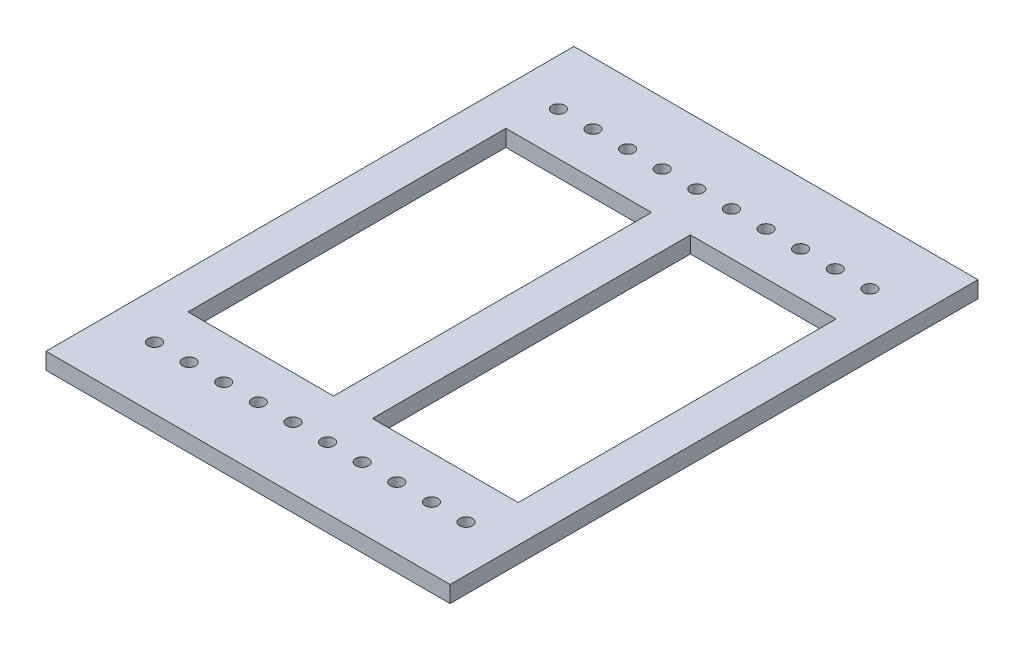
from build123d import *

# Parameters (mm, degrees)
SKETCH1_W           = 20.78
SKETCH1_H           = 27.15
SKETCH1_R           = 0.33
SKETCH1_W_2         = 7.49
SKETCH1_H_2         = 16.35
BOSS_EXTRUDE1_DEPTH = 0.85


with BuildPart() as part:
    # Sketch1 → Boss-Extrude1 (new body)
    with BuildSketch(Plane(origin=(0, 0, 0), x_dir=(1, 0, 0), z_dir=(0, 1, 0))):
        with Locations((10.39, 13.575)):
            Rectangle(SKETCH1_W, SKETCH1_H)
        with Locations(Location((2.389, 23.96, 0), (0, 0, 270))):
            Circle(SKETCH1_R, mode=Mode.SUBTRACT)
        with Locations(Location((4.169, 23.96, 0), (0, 0, 270))):
            Circle(SKETCH1_R, mode=Mode.SUBTRACT)
        with Locations(Location((5.949, 23.96, 0), (0, 0, 270))):
            Circle(SKETCH1_R, mode=Mode.SUBTRACT)
        with Locations(Location((7.729, 23.96, 0), (0, 0, 270))):
            Circle(SKETCH1_R, mode=Mode.SUBTRACT)
        with Locations(Location((9.509, 23.96, 0), (0, 0, 270))):
            Circle(SKETCH1_R, mode=Mode.SUBTRACT)
        with Locations(Location((11.289, 23.96, 0), (0, 0, 270))):
            Circle(SKETCH1_R, mode=Mode.SUBTRACT)
        with Locations(Location((13.069, 23.96, 0), (0, 0, 270))):
            Circle(SKETCH1_R, mode=Mode.SUBTRACT)
        with Locations(Location((14.849, 23.96, 0), (0, 0, 270))):
            Circle(SKETCH1_R, mode=Mode.SUBTRACT)
        with Locations(Location((16.629, 23.96, 0), (0, 0, 270))):
            Circle(SKETCH1_R, mode=Mode.SUBTRACT)
        with Locations(Location((18.409, 23.96, 0), (0, 0, 270))):
            Circle(SKETCH1_R, mode=Mode.SUBTRACT)
        with Locations(Location((18.409, 3.19, 0), (0, 0, 90))):
            Circle(SKETCH1_R, mode=Mode.SUBTRACT)
        with Locations(Location((16.629, 3.19, 0), (0, 0, 90))):
            Circle(SKETCH1_R, mode=Mode.SUBTRACT)
        with Locations(Location((14.849, 3.19, 0), (0, 0, 90))):
            Circle(SKETCH1_R, mode=Mode.SUBTRACT)
        with Locations(Location((13.069, 3.19, 0), (0, 0, 90))):
            Circle(SKETCH1_R, mode=Mode.SUBTRACT)
        with Locations(Location((11.289, 3.19, 0), (0, 0, 90))):
            Circle(SKETCH1_R, mode=Mode.SUBTRACT)
        with Locations(Location((9.509, 3.19, 0), (0, 0, 90))):
            Circle(SKETCH1_R, mode=Mode.SUBTRACT)
        with Locations(Location((7.729, 3.19, 0), (0, 0, 90))):
            Circle(SKETCH1_R, mode=Mode.SUBTRACT)
        with Locations(Location((5.949, 3.19, 0), (0, 0, 90))):
            Circle(SKETCH1_R, mode=Mode.SUBTRACT)
        with Locations(Location((4.169, 3.19, 0), (0, 0, 90))):
            Circle(SKETCH1_R, mode=Mode.SUBTRACT)
        with Locations(Location((2.389, 3.19, 0), (0, 0, 90))):
            Circle(SKETCH1_R, mode=Mode.SUBTRACT)
        with Locations((15.135, 13.575)):
            Rectangle(SKETCH1_W_2, SKETCH1_H_2, mode=Mode.SUBTRACT)
        with Locations((5.645, 13.575)):
            Rectangle(SKETCH1_W_2, SKETCH1_H_2, mode=Mode.SUBTRACT)
    extrude(amount=BOSS_EXTRUDE1_DEPTH)


solid = part.part
